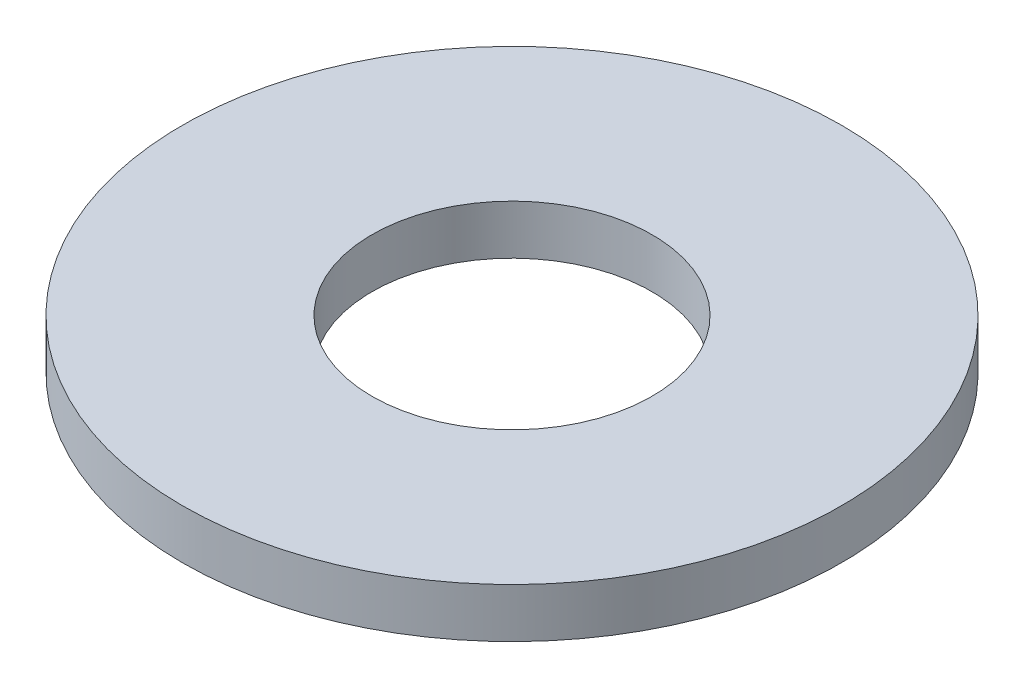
from build123d import *

# Parameters (mm, degrees)
SKETCH1_R      = 2
SKETCH1_R_2    = 0.85
EXTRUDE1_DEPTH = 0.3


with BuildPart() as part:
    # Sketch1 → Extrude1 (new body)
    with BuildSketch(Plane(origin=(0, 0, 0), x_dir=(1, 0, 0), z_dir=(0, 1, 0))):
        with Locations(Location((0, 0, 0), (0, 0, 270))):
            Circle(SKETCH1_R)
        with Locations(Location((0, 0, 0), (0, 0, 270))):
            Circle(SKETCH1_R_2, mode=Mode.SUBTRACT)
    extrude(amount=EXTRUDE1_DEPTH)


solid = part.part
